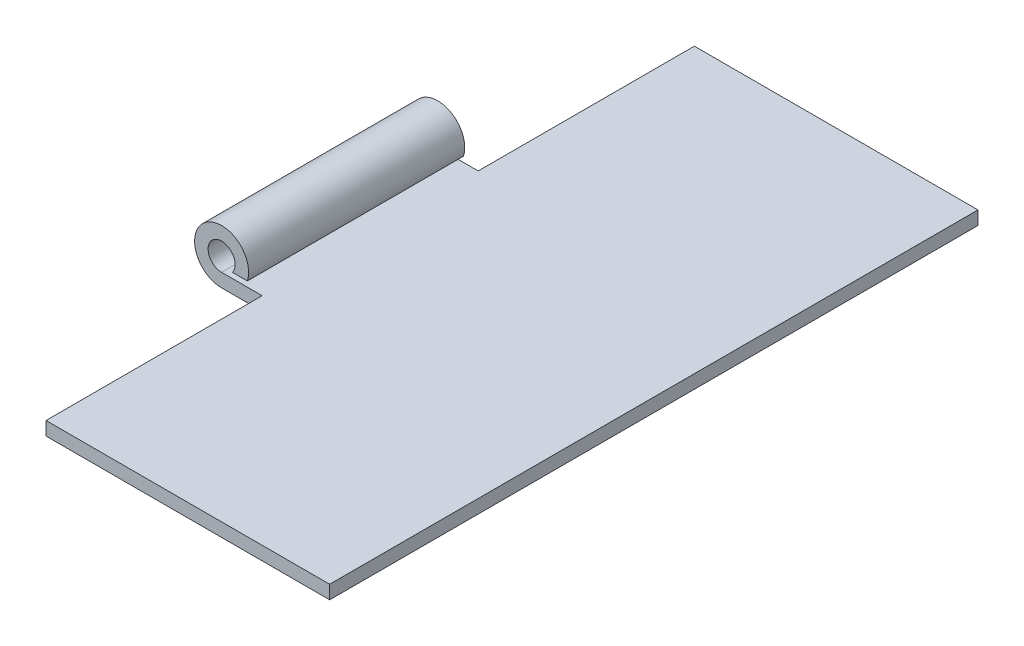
ISO-10303-21;
HEADER;
FILE_DESCRIPTION(('STEP AP214'),'2;1');
FILE_NAME('part.step','',(''),(''),'','','');
FILE_SCHEMA(('AUTOMOTIVE_DESIGN { 1 0 10303 214 1 1 1 1 }'));
ENDSEC;
DATA;
#1=APPLICATION_CONTEXT('core data for automotive mechanical design processes');
#2=APPLICATION_PROTOCOL_DEFINITION('international standard','automotive_design',2000,#1);
#3=PRODUCT_CONTEXT('',#1,'mechanical');
#4=PRODUCT('Part','Part','',(#3));
#5=PRODUCT_RELATED_PRODUCT_CATEGORY('part','',(#4));
#6=PRODUCT_DEFINITION_FORMATION('','',#4);
#7=PRODUCT_DEFINITION_CONTEXT('part definition',#1,'design');
#8=PRODUCT_DEFINITION('design','',#6,#7);
#9=PRODUCT_DEFINITION_SHAPE('','',#8);
#10=(LENGTH_UNIT() NAMED_UNIT(*) SI_UNIT(.MILLI.,.METRE.));
#11=(NAMED_UNIT(*) PLANE_ANGLE_UNIT() SI_UNIT($,.RADIAN.));
#12=(NAMED_UNIT(*) SI_UNIT($,.STERADIAN.) SOLID_ANGLE_UNIT());
#13=UNCERTAINTY_MEASURE_WITH_UNIT(LENGTH_MEASURE(1.E-05),#10,'distance_accuracy_value','');
#14=(GEOMETRIC_REPRESENTATION_CONTEXT(3) GLOBAL_UNCERTAINTY_ASSIGNED_CONTEXT((#13)) GLOBAL_UNIT_ASSIGNED_CONTEXT((#10,
#11,#12)) REPRESENTATION_CONTEXT('',''));
#15=CARTESIAN_POINT('',(0.,0.,0.));
#16=DIRECTION('',(0.,0.,1.));
#17=DIRECTION('',(1.,0.,0.));
#18=AXIS2_PLACEMENT_3D('',#15,#16,#17);
#19=CARTESIAN_POINT('',(39.59012726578,8.80634716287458,60.));
#20=DIRECTION('',(0.,0.,-1.));
#21=DIRECTION('',(-1.,0.,0.));
#22=AXIS2_PLACEMENT_3D('',#19,#20,#21);
#23=CYLINDRICAL_SURFACE('',#22,2.5);
#24=DIRECTION('',(0.,0.,-1.));
#25=VECTOR('',#24,1.);
#26=CARTESIAN_POINT('',(39.59012726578,6.30634716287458,60.));
#27=LINE('',#26,#25);
#28=CARTESIAN_POINT('',(39.59012726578,6.30634716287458,20.));
#29=VERTEX_POINT('',#28);
#30=CARTESIAN_POINT('',(39.59012726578,6.30634716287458,0.));
#31=VERTEX_POINT('',#30);
#32=EDGE_CURVE('E138',#29,#31,#27,.T.);
#33=ORIENTED_EDGE('',*,*,#32,.T.);
#34=CARTESIAN_POINT('',(39.59012726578,8.80634716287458,0.));
#35=DIRECTION('',(0.,0.,-1.));
#36=DIRECTION('',(-1.,0.,0.));
#37=AXIS2_PLACEMENT_3D('',#34,#35,#36);
#38=CIRCLE('',#37,2.5);
#39=CARTESIAN_POINT('',(41.59012726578,7.30634716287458,0.));
#40=VERTEX_POINT('',#39);
#41=EDGE_CURVE('E11',#31,#40,#38,.T.);
#42=ORIENTED_EDGE('',*,*,#41,.T.);
#43=DIRECTION('',(0.,0.,-1.));
#44=VECTOR('',#43,1.);
#45=CARTESIAN_POINT('',(41.59012726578,7.30634716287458,60.));
#46=LINE('',#45,#44);
#47=CARTESIAN_POINT('',(41.59012726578,7.30634716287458,20.));
#48=VERTEX_POINT('',#47);
#49=EDGE_CURVE('E185',#48,#40,#46,.T.);
#50=ORIENTED_EDGE('',*,*,#49,.F.);
#51=CARTESIAN_POINT('',(39.59012726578,8.80634716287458,20.));
#52=DIRECTION('',(0.,0.,1.));
#53=DIRECTION('',(1.,0.,0.));
#54=AXIS2_PLACEMENT_3D('',#51,#52,#53);
#55=CIRCLE('',#54,2.5);
#56=EDGE_CURVE('E140',#48,#29,#55,.T.);
#57=ORIENTED_EDGE('',*,*,#56,.T.);
#58=EDGE_LOOP('',(#33,#42,#50,#57));
#59=FACE_BOUND('',#58,.T.);
#60=ADVANCED_FACE('F36',(#59),#23,.F.);
#61=CARTESIAN_POINT('',(39.59012726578,8.80634716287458,60.));
#62=DIRECTION('',(0.,0.,-1.));
#63=DIRECTION('',(-1.,0.,0.));
#64=AXIS2_PLACEMENT_3D('',#61,#62,#63);
#65=CYLINDRICAL_SURFACE('',#64,5.);
#66=CARTESIAN_POINT('',(39.59012726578,8.80634716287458,20.));
#67=DIRECTION('',(0.,0.,1.));
#68=DIRECTION('',(1.,0.,0.));
#69=AXIS2_PLACEMENT_3D('',#66,#67,#68);
#70=CIRCLE('',#69,5.);
#71=CARTESIAN_POINT('',(44.3598232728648,7.30634716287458,20.));
#72=VERTEX_POINT('',#71);
#73=CARTESIAN_POINT('',(39.59012726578,3.80634716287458,20.));
#74=VERTEX_POINT('',#73);
#75=EDGE_CURVE('E139',#72,#74,#70,.T.);
#76=ORIENTED_EDGE('',*,*,#75,.F.);
#77=DIRECTION('',(0.,0.,-1.));
#78=VECTOR('',#77,1.);
#79=CARTESIAN_POINT('',(44.3598232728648,7.30634716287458,60.));
#80=LINE('',#79,#78);
#81=CARTESIAN_POINT('',(44.3598232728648,7.30634716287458,-20.));
#82=VERTEX_POINT('',#81);
#83=EDGE_CURVE('E182',#72,#82,#80,.T.);
#84=ORIENTED_EDGE('',*,*,#83,.T.);
#85=CARTESIAN_POINT('',(39.59012726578,8.80634716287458,-20.));
#86=DIRECTION('',(0.,0.,1.));
#87=DIRECTION('',(1.,0.,0.));
#88=AXIS2_PLACEMENT_3D('',#85,#86,#87);
#89=CIRCLE('',#88,5.);
#90=CARTESIAN_POINT('',(39.59012726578,3.80634716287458,-20.));
#91=VERTEX_POINT('',#90);
#92=EDGE_CURVE('E162',#82,#91,#89,.T.);
#93=ORIENTED_EDGE('',*,*,#92,.T.);
#94=DIRECTION('',(0.,0.,-1.));
#95=VECTOR('',#94,1.);
#96=CARTESIAN_POINT('',(39.59012726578,3.80634716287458,60.));
#97=LINE('',#96,#95);
#98=EDGE_CURVE('E196',#74,#91,#97,.T.);
#99=ORIENTED_EDGE('',*,*,#98,.F.);
#100=EDGE_LOOP('',(#76,#84,#93,#99));
#101=FACE_BOUND('',#100,.T.);
#102=ADVANCED_FACE('F207',(#101),#65,.T.);
#103=ORIENTED_EDGE('',*,*,#41,.F.);
#104=CARTESIAN_POINT('',(39.59012726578,6.30634716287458,-20.));
#105=VERTEX_POINT('',#104);
#106=EDGE_CURVE('E188',#31,#105,#27,.T.);
#107=ORIENTED_EDGE('',*,*,#106,.T.);
#108=CARTESIAN_POINT('',(39.59012726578,8.80634716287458,-20.));
#109=DIRECTION('',(0.,0.,1.));
#110=DIRECTION('',(1.,0.,0.));
#111=AXIS2_PLACEMENT_3D('',#108,#109,#110);
#112=CIRCLE('',#111,2.5);
#113=CARTESIAN_POINT('',(41.59012726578,7.30634716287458,-20.));
#114=VERTEX_POINT('',#113);
#115=EDGE_CURVE('E157',#114,#105,#112,.T.);
#116=ORIENTED_EDGE('',*,*,#115,.F.);
#117=EDGE_CURVE('E184',#40,#114,#46,.T.);
#118=ORIENTED_EDGE('',*,*,#117,.F.);
#119=EDGE_LOOP('',(#103,#107,#116,#118));
#120=FACE_BOUND('',#119,.T.);
#121=ADVANCED_FACE('F209',(#120),#23,.F.);
#122=CARTESIAN_POINT('',(44.3598232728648,7.30634716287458,60.));
#123=DIRECTION('',(0.,-1.,0.));
#124=DIRECTION('',(1.,0.,0.));
#125=AXIS2_PLACEMENT_3D('',#122,#123,#124);
#126=PLANE('',#125);
#127=ORIENTED_EDGE('',*,*,#83,.F.);
#128=DIRECTION('',(-1.,0.,0.));
#129=VECTOR('',#128,1.);
#130=CARTESIAN_POINT('',(44.3598232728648,7.30634716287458,20.));
#131=LINE('',#130,#129);
#132=EDGE_CURVE('E45',#72,#48,#131,.T.);
#133=ORIENTED_EDGE('',*,*,#132,.T.);
#134=ORIENTED_EDGE('',*,*,#49,.T.);
#135=ORIENTED_EDGE('',*,*,#117,.T.);
#136=DIRECTION('',(-1.,0.,0.));
#137=VECTOR('',#136,1.);
#138=CARTESIAN_POINT('',(44.3598232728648,7.30634716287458,-20.));
#139=LINE('',#138,#137);
#140=EDGE_CURVE('E198',#82,#114,#139,.T.);
#141=ORIENTED_EDGE('',*,*,#140,.F.);
#142=EDGE_LOOP('',(#127,#133,#134,#135,#141));
#143=FACE_BOUND('',#142,.T.);
#144=ADVANCED_FACE('F203',(#143),#126,.T.);
#145=CARTESIAN_POINT('',(39.59012726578,8.80634716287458,-60.));
#146=DIRECTION('',(0.,0.,1.));
#147=DIRECTION('',(1.,0.,0.));
#148=AXIS2_PLACEMENT_3D('',#145,#146,#147);
#149=PLANE('',#148);
#150=DIRECTION('',(0.,-1.,0.));
#151=VECTOR('',#150,1.);
#152=CARTESIAN_POINT('',(47.09012726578,40.,-60.));
#153=LINE('',#152,#151);
#154=CARTESIAN_POINT('',(47.09012726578,6.30634716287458,-60.));
#155=VERTEX_POINT('',#154);
#156=CARTESIAN_POINT('',(47.09012726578,3.80634716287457,-60.));
#157=VERTEX_POINT('',#156);
#158=EDGE_CURVE('E147',#155,#157,#153,.T.);
#159=ORIENTED_EDGE('',*,*,#158,.F.);
#160=DIRECTION('',(1.,0.,0.));
#161=VECTOR('',#160,1.);
#162=CARTESIAN_POINT('',(39.59012726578,6.30634716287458,-60.));
#163=LINE('',#162,#161);
#164=CARTESIAN_POINT('',(99.59012726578,6.30634716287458,-60.));
#165=VERTEX_POINT('',#164);
#166=EDGE_CURVE('E173',#155,#165,#163,.T.);
#167=ORIENTED_EDGE('',*,*,#166,.T.);
#168=DIRECTION('',(0.,1.,0.));
#169=VECTOR('',#168,1.);
#170=CARTESIAN_POINT('',(99.59012726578,3.80634716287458,-60.));
#171=LINE('',#170,#169);
#172=CARTESIAN_POINT('',(99.59012726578,3.80634716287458,-60.));
#173=VERTEX_POINT('',#172);
#174=EDGE_CURVE('E170',#173,#165,#171,.T.);
#175=ORIENTED_EDGE('',*,*,#174,.F.);
#176=DIRECTION('',(1.,0.,0.));
#177=VECTOR('',#176,1.);
#178=CARTESIAN_POINT('',(39.59012726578,3.80634716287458,-60.));
#179=LINE('',#178,#177);
#180=EDGE_CURVE('E168',#157,#173,#179,.T.);
#181=ORIENTED_EDGE('',*,*,#180,.F.);
#182=EDGE_LOOP('',(#159,#167,#175,#181));
#183=FACE_BOUND('',#182,.T.);
#184=ADVANCED_FACE('F221',(#183),#149,.F.);
#185=CARTESIAN_POINT('',(39.59012726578,3.80634716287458,60.));
#186=DIRECTION('',(0.,1.,0.));
#187=DIRECTION('',(0.,0.,1.));
#188=AXIS2_PLACEMENT_3D('',#185,#186,#187);
#189=PLANE('',#188);
#190=DIRECTION('',(1.,0.,0.));
#191=VECTOR('',#190,1.);
#192=CARTESIAN_POINT('',(39.59012726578,3.80634716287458,60.));
#193=LINE('',#192,#191);
#194=CARTESIAN_POINT('',(47.09012726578,3.80634716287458,60.));
#195=VERTEX_POINT('',#194);
#196=CARTESIAN_POINT('',(99.59012726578,3.80634716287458,60.));
#197=VERTEX_POINT('',#196);
#198=EDGE_CURVE('E175',#195,#197,#193,.T.);
#199=ORIENTED_EDGE('',*,*,#198,.F.);
#200=DIRECTION('',(0.,0.,-1.));
#201=VECTOR('',#200,1.);
#202=CARTESIAN_POINT('',(47.09012726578,3.80634716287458,60.));
#203=LINE('',#202,#201);
#204=CARTESIAN_POINT('',(47.09012726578,3.80634716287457,20.));
#205=VERTEX_POINT('',#204);
#206=EDGE_CURVE('E127',#195,#205,#203,.T.);
#207=ORIENTED_EDGE('',*,*,#206,.T.);
#208=DIRECTION('',(1.,0.,0.));
#209=VECTOR('',#208,1.);
#210=CARTESIAN_POINT('',(39.59012726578,3.80634716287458,20.));
#211=LINE('',#210,#209);
#212=EDGE_CURVE('E134',#74,#205,#211,.T.);
#213=ORIENTED_EDGE('',*,*,#212,.F.);
#214=ORIENTED_EDGE('',*,*,#98,.T.);
#215=DIRECTION('',(1.,0.,0.));
#216=VECTOR('',#215,1.);
#217=CARTESIAN_POINT('',(39.59012726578,3.80634716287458,-20.));
#218=LINE('',#217,#216);
#219=CARTESIAN_POINT('',(47.09012726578,3.80634716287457,-20.));
#220=VERTEX_POINT('',#219);
#221=EDGE_CURVE('E165',#91,#220,#218,.T.);
#222=ORIENTED_EDGE('',*,*,#221,.T.);
#223=DIRECTION('',(0.,0.,1.));
#224=VECTOR('',#223,1.);
#225=CARTESIAN_POINT('',(47.09012726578,3.80634716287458,60.));
#226=LINE('',#225,#224);
#227=EDGE_CURVE('E155',#157,#220,#226,.T.);
#228=ORIENTED_EDGE('',*,*,#227,.F.);
#229=ORIENTED_EDGE('',*,*,#180,.T.);
#230=DIRECTION('',(0.,0.,-1.));
#231=VECTOR('',#230,1.);
#232=CARTESIAN_POINT('',(99.59012726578,3.80634716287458,60.));
#233=LINE('',#232,#231);
#234=EDGE_CURVE('E193',#197,#173,#233,.T.);
#235=ORIENTED_EDGE('',*,*,#234,.F.);
#236=EDGE_LOOP('',(#199,#207,#213,#214,#222,#228,#229,#235));
#237=FACE_BOUND('',#236,.T.);
#238=ADVANCED_FACE('F38',(#237),#189,.F.);
#239=CARTESIAN_POINT('',(99.59012726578,3.80634716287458,60.));
#240=DIRECTION('',(-1.,0.,0.));
#241=DIRECTION('',(0.,0.,1.));
#242=AXIS2_PLACEMENT_3D('',#239,#240,#241);
#243=PLANE('',#242);
#244=DIRECTION('',(0.,0.,-1.));
#245=VECTOR('',#244,1.);
#246=CARTESIAN_POINT('',(99.59012726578,6.30634716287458,60.));
#247=LINE('',#246,#245);
#248=CARTESIAN_POINT('',(99.59012726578,6.30634716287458,60.));
#249=VERTEX_POINT('',#248);
#250=EDGE_CURVE('E190',#249,#165,#247,.T.);
#251=ORIENTED_EDGE('',*,*,#250,.F.);
#252=DIRECTION('',(0.,1.,0.));
#253=VECTOR('',#252,1.);
#254=CARTESIAN_POINT('',(99.59012726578,3.80634716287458,60.));
#255=LINE('',#254,#253);
#256=EDGE_CURVE('E177',#197,#249,#255,.T.);
#257=ORIENTED_EDGE('',*,*,#256,.F.);
#258=ORIENTED_EDGE('',*,*,#234,.T.);
#259=ORIENTED_EDGE('',*,*,#174,.T.);
#260=EDGE_LOOP('',(#251,#257,#258,#259));
#261=FACE_BOUND('',#260,.T.);
#262=ADVANCED_FACE('F291',(#261),#243,.F.);
#263=CARTESIAN_POINT('',(39.59012726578,6.30634716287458,60.));
#264=DIRECTION('',(0.,1.,0.));
#265=DIRECTION('',(0.,0.,1.));
#266=AXIS2_PLACEMENT_3D('',#263,#264,#265);
#267=PLANE('',#266);
#268=DIRECTION('',(0.,0.,-1.));
#269=VECTOR('',#268,1.);
#270=CARTESIAN_POINT('',(47.09012726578,6.30634716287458,60.));
#271=LINE('',#270,#269);
#272=CARTESIAN_POINT('',(47.09012726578,6.30634716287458,60.));
#273=VERTEX_POINT('',#272);
#274=CARTESIAN_POINT('',(47.09012726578,6.30634716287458,20.));
#275=VERTEX_POINT('',#274);
#276=EDGE_CURVE('E117',#273,#275,#271,.T.);
#277=ORIENTED_EDGE('',*,*,#276,.F.);
#278=DIRECTION('',(1.,0.,0.));
#279=VECTOR('',#278,1.);
#280=CARTESIAN_POINT('',(39.59012726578,6.30634716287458,60.));
#281=LINE('',#280,#279);
#282=EDGE_CURVE('E180',#273,#249,#281,.T.);
#283=ORIENTED_EDGE('',*,*,#282,.T.);
#284=ORIENTED_EDGE('',*,*,#250,.T.);
#285=ORIENTED_EDGE('',*,*,#166,.F.);
#286=DIRECTION('',(0.,0.,1.));
#287=VECTOR('',#286,1.);
#288=CARTESIAN_POINT('',(47.09012726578,6.30634716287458,60.));
#289=LINE('',#288,#287);
#290=CARTESIAN_POINT('',(47.09012726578,6.30634716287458,-20.));
#291=VERTEX_POINT('',#290);
#292=EDGE_CURVE('E152',#155,#291,#289,.T.);
#293=ORIENTED_EDGE('',*,*,#292,.T.);
#294=DIRECTION('',(1.,0.,0.));
#295=VECTOR('',#294,1.);
#296=CARTESIAN_POINT('',(39.59012726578,6.30634716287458,-20.));
#297=LINE('',#296,#295);
#298=EDGE_CURVE('E160',#105,#291,#297,.T.);
#299=ORIENTED_EDGE('',*,*,#298,.F.);
#300=ORIENTED_EDGE('',*,*,#106,.F.);
#301=ORIENTED_EDGE('',*,*,#32,.F.);
#302=DIRECTION('',(1.,0.,0.));
#303=VECTOR('',#302,1.);
#304=CARTESIAN_POINT('',(39.59012726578,6.30634716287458,20.));
#305=LINE('',#304,#303);
#306=EDGE_CURVE('E131',#29,#275,#305,.T.);
#307=ORIENTED_EDGE('',*,*,#306,.T.);
#308=EDGE_LOOP('',(#277,#283,#284,#285,#293,#299,#300,#301,#307));
#309=FACE_BOUND('',#308,.T.);
#310=ADVANCED_FACE('F137',(#309),#267,.T.);
#311=CARTESIAN_POINT('',(39.59012726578,8.80634716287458,60.));
#312=DIRECTION('',(0.,0.,1.));
#313=DIRECTION('',(1.,0.,0.));
#314=AXIS2_PLACEMENT_3D('',#311,#312,#313);
#315=PLANE('',#314);
#316=DIRECTION('',(0.,-1.,0.));
#317=VECTOR('',#316,1.);
#318=CARTESIAN_POINT('',(47.09012726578,40.,60.));
#319=LINE('',#318,#317);
#320=EDGE_CURVE('E123',#273,#195,#319,.T.);
#321=ORIENTED_EDGE('',*,*,#320,.T.);
#322=ORIENTED_EDGE('',*,*,#198,.T.);
#323=ORIENTED_EDGE('',*,*,#256,.T.);
#324=ORIENTED_EDGE('',*,*,#282,.F.);
#325=EDGE_LOOP('',(#321,#322,#323,#324));
#326=FACE_BOUND('',#325,.T.);
#327=ADVANCED_FACE('F228',(#326),#315,.T.);
#328=CARTESIAN_POINT('',(47.09012726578,40.,-20.));
#329=DIRECTION('',(0.,0.,1.));
#330=DIRECTION('',(1.,0.,0.));
#331=AXIS2_PLACEMENT_3D('',#328,#329,#330);
#332=PLANE('',#331);
#333=ORIENTED_EDGE('',*,*,#92,.F.);
#334=ORIENTED_EDGE('',*,*,#140,.T.);
#335=ORIENTED_EDGE('',*,*,#115,.T.);
#336=ORIENTED_EDGE('',*,*,#298,.T.);
#337=DIRECTION('',(0.,-1.,0.));
#338=VECTOR('',#337,1.);
#339=CARTESIAN_POINT('',(47.09012726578,40.,-20.));
#340=LINE('',#339,#338);
#341=EDGE_CURVE('E149',#291,#220,#340,.T.);
#342=ORIENTED_EDGE('',*,*,#341,.T.);
#343=ORIENTED_EDGE('',*,*,#221,.F.);
#344=EDGE_LOOP('',(#333,#334,#335,#336,#342,#343));
#345=FACE_BOUND('',#344,.T.);
#346=ADVANCED_FACE('F230',(#345),#332,.F.);
#347=CARTESIAN_POINT('',(47.09012726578,40.,-20.));
#348=DIRECTION('',(-1.,0.,0.));
#349=DIRECTION('',(0.,0.,1.));
#350=AXIS2_PLACEMENT_3D('',#347,#348,#349);
#351=PLANE('',#350);
#352=ORIENTED_EDGE('',*,*,#227,.T.);
#353=ORIENTED_EDGE('',*,*,#341,.F.);
#354=ORIENTED_EDGE('',*,*,#292,.F.);
#355=ORIENTED_EDGE('',*,*,#158,.T.);
#356=EDGE_LOOP('',(#352,#353,#354,#355));
#357=FACE_BOUND('',#356,.T.);
#358=ADVANCED_FACE('F235',(#357),#351,.T.);
#359=CARTESIAN_POINT('',(47.09012726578,40.,20.));
#360=DIRECTION('',(0.,0.,1.));
#361=DIRECTION('',(1.,0.,0.));
#362=AXIS2_PLACEMENT_3D('',#359,#360,#361);
#363=PLANE('',#362);
#364=ORIENTED_EDGE('',*,*,#212,.T.);
#365=DIRECTION('',(0.,-1.,0.));
#366=VECTOR('',#365,1.);
#367=CARTESIAN_POINT('',(47.09012726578,40.,20.));
#368=LINE('',#367,#366);
#369=EDGE_CURVE('E120',#275,#205,#368,.T.);
#370=ORIENTED_EDGE('',*,*,#369,.F.);
#371=ORIENTED_EDGE('',*,*,#306,.F.);
#372=ORIENTED_EDGE('',*,*,#56,.F.);
#373=ORIENTED_EDGE('',*,*,#132,.F.);
#374=ORIENTED_EDGE('',*,*,#75,.T.);
#375=EDGE_LOOP('',(#364,#370,#371,#372,#373,#374));
#376=FACE_BOUND('',#375,.T.);
#377=ADVANCED_FACE('F130',(#376),#363,.T.);
#378=CARTESIAN_POINT('',(47.09012726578,40.,20.));
#379=DIRECTION('',(1.,0.,0.));
#380=DIRECTION('',(0.,0.,-1.));
#381=AXIS2_PLACEMENT_3D('',#378,#379,#380);
#382=PLANE('',#381);
#383=ORIENTED_EDGE('',*,*,#320,.F.);
#384=ORIENTED_EDGE('',*,*,#276,.T.);
#385=ORIENTED_EDGE('',*,*,#369,.T.);
#386=ORIENTED_EDGE('',*,*,#206,.F.);
#387=EDGE_LOOP('',(#383,#384,#385,#386));
#388=FACE_BOUND('',#387,.T.);
#389=ADVANCED_FACE('F119',(#388),#382,.F.);
#390=CLOSED_SHELL('',(#60,#102,#121,#144,#184,#238,#262,#310,#327,#346,#358,#377,#389));
#391=MANIFOLD_SOLID_BREP('B2',#390);
#392=ADVANCED_BREP_SHAPE_REPRESENTATION('',(#18,#391),#14);
#393=SHAPE_DEFINITION_REPRESENTATION(#9,#392);
ENDSEC;
END-ISO-10303-21;
